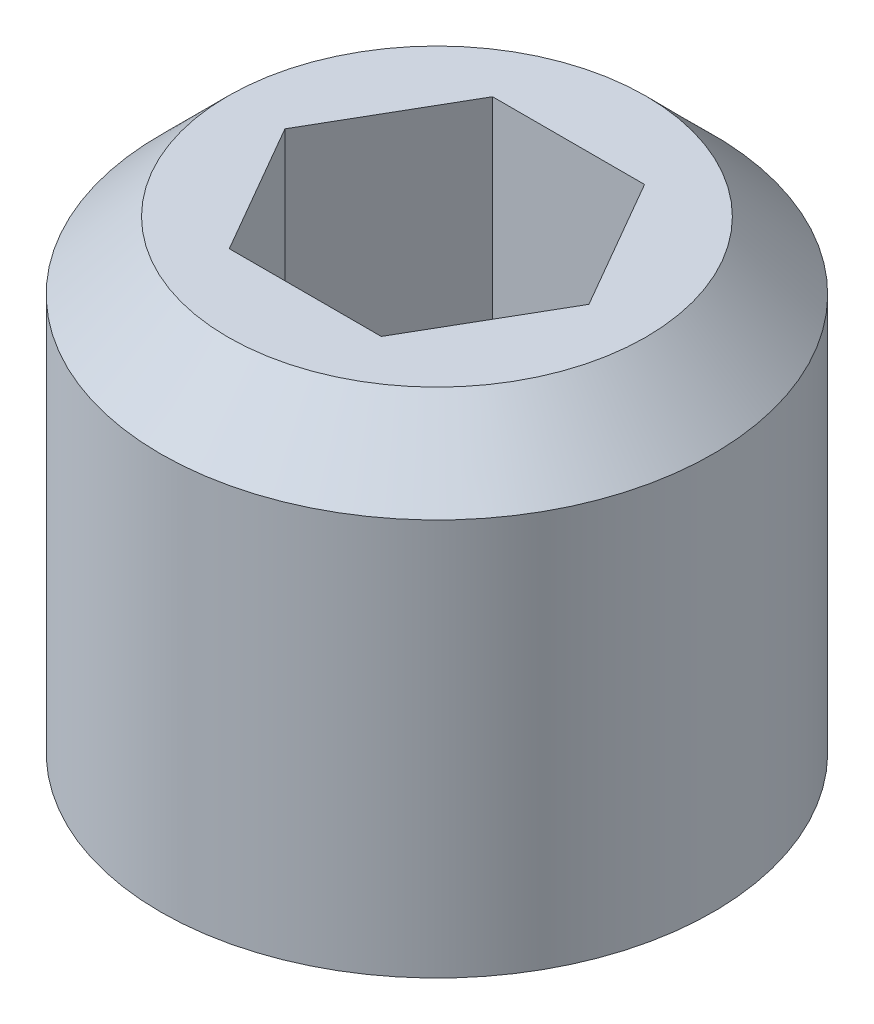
from build123d import *

# Parameters (mm, degrees)
CUT_EXTRUDE1_DEPTH = 2.286


with BuildPart() as part:
    # Sketch1 → Revolve1 (revolve)
    with BuildSketch(Plane.XY, mode=Mode.PRIVATE) as revolve1_sk:
        Polygon((0, 0), (1.5748, 0), (2.0828, -0.508), (2.0828, -3.498327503), (0, -4.7498), align=None)
    revolve(revolve1_sk.sketch.rotate(Axis((0, 12.164607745, 0), (0, -1, 0)), 90), axis=Axis((0, 12.164607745, 0), (0, -1, 0)))

    # Sketch2 → Cut-Extrude1 (cut)
    with BuildSketch(Plane(origin=(0, 0, 0), x_dir=(-1, 0, 0), z_dir=(0, 1, 0))):
        Polygon((-1.14567944, 0), (-0.57283972, -0.9921875), (0.57283972, -0.9921875), (1.14567944, 0), (0.57283972, 0.9921875), (-0.57283972, 0.9921875), align=None)
    extrude(amount=-CUT_EXTRUDE1_DEPTH, mode=Mode.SUBTRACT)


solid = part.part
